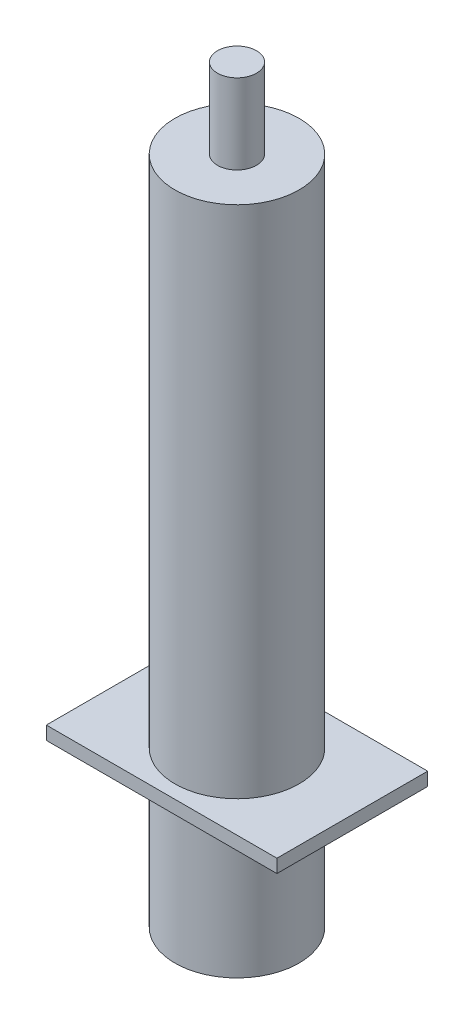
ISO-10303-21;
HEADER;
FILE_DESCRIPTION(('STEP AP214'),'2;1');
FILE_NAME('part.step','',(''),(''),'','','');
FILE_SCHEMA(('AUTOMOTIVE_DESIGN { 1 0 10303 214 1 1 1 1 }'));
ENDSEC;
DATA;
#1=APPLICATION_CONTEXT('core data for automotive mechanical design processes');
#2=APPLICATION_PROTOCOL_DEFINITION('international standard','automotive_design',2000,#1);
#3=PRODUCT_CONTEXT('',#1,'mechanical');
#4=PRODUCT('Part','Part','',(#3));
#5=PRODUCT_RELATED_PRODUCT_CATEGORY('part','',(#4));
#6=PRODUCT_DEFINITION_FORMATION('','',#4);
#7=PRODUCT_DEFINITION_CONTEXT('part definition',#1,'design');
#8=PRODUCT_DEFINITION('design','',#6,#7);
#9=PRODUCT_DEFINITION_SHAPE('','',#8);
#10=(LENGTH_UNIT() NAMED_UNIT(*) SI_UNIT(.MILLI.,.METRE.));
#11=(NAMED_UNIT(*) PLANE_ANGLE_UNIT() SI_UNIT($,.RADIAN.));
#12=(NAMED_UNIT(*) SI_UNIT($,.STERADIAN.) SOLID_ANGLE_UNIT());
#13=UNCERTAINTY_MEASURE_WITH_UNIT(LENGTH_MEASURE(1.E-05),#10,'distance_accuracy_value','');
#14=(GEOMETRIC_REPRESENTATION_CONTEXT(3) GLOBAL_UNCERTAINTY_ASSIGNED_CONTEXT((#13)) GLOBAL_UNIT_ASSIGNED_CONTEXT((#10,
#11,#12)) REPRESENTATION_CONTEXT('',''));
#15=CARTESIAN_POINT('',(0.,0.,0.));
#16=DIRECTION('',(0.,0.,1.));
#17=DIRECTION('',(1.,0.,0.));
#18=AXIS2_PLACEMENT_3D('',#15,#16,#17);
#19=CARTESIAN_POINT('',(0.,58.,0.));
#20=DIRECTION('',(0.,-1.,0.));
#21=DIRECTION('',(0.,0.,-1.));
#22=AXIS2_PLACEMENT_3D('',#19,#20,#21);
#23=CYLINDRICAL_SURFACE('',#22,7.);
#24=CARTESIAN_POINT('',(0.,58.,0.));
#25=DIRECTION('',(0.,1.,0.));
#26=DIRECTION('',(0.,0.,1.));
#27=AXIS2_PLACEMENT_3D('',#24,#25,#26);
#28=CIRCLE('',#27,7.);
#29=CARTESIAN_POINT('',(0.,58.,-7.));
#30=VERTEX_POINT('',#29);
#31=EDGE_CURVE('E125',#30,#30,#28,.T.);
#32=CARTESIAN_POINT('',(0.,0.,0.));
#33=DIRECTION('',(0.,1.,0.));
#34=DIRECTION('',(0.,0.,1.));
#35=AXIS2_PLACEMENT_3D('',#32,#33,#34);
#36=CIRCLE('',#35,7.);
#37=CARTESIAN_POINT('',(0.,0.,-7.));
#38=VERTEX_POINT('',#37);
#39=EDGE_CURVE('E44',#38,#38,#36,.T.);
#40=CARTESIAN_POINT('',(0.,58.,-7.));
#41=CARTESIAN_POINT('',(0.,57.3958333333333,-7.));
#42=CARTESIAN_POINT('',(0.,56.7916666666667,-7.));
#43=CARTESIAN_POINT('',(0.,55.5833333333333,-7.));
#44=CARTESIAN_POINT('',(0.,54.9791666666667,-7.));
#45=CARTESIAN_POINT('',(0.,53.7708333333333,-7.));
#46=CARTESIAN_POINT('',(0.,53.1666666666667,-7.));
#47=CARTESIAN_POINT('',(0.,51.9583333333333,-7.));
#48=CARTESIAN_POINT('',(0.,51.3541666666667,-7.));
#49=CARTESIAN_POINT('',(0.,50.1458333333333,-7.));
#50=CARTESIAN_POINT('',(0.,49.5416666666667,-7.));
#51=CARTESIAN_POINT('',(0.,48.3333333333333,-7.));
#52=CARTESIAN_POINT('',(0.,47.7291666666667,-7.));
#53=CARTESIAN_POINT('',(0.,46.5208333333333,-7.));
#54=CARTESIAN_POINT('',(0.,45.9166666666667,-7.));
#55=CARTESIAN_POINT('',(0.,44.7083333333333,-7.));
#56=CARTESIAN_POINT('',(0.,44.1041666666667,-7.));
#57=CARTESIAN_POINT('',(0.,42.8958333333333,-7.));
#58=CARTESIAN_POINT('',(0.,42.2916666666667,-7.));
#59=CARTESIAN_POINT('',(0.,41.0833333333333,-7.));
#60=CARTESIAN_POINT('',(0.,40.4791666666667,-7.));
#61=CARTESIAN_POINT('',(0.,39.2708333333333,-7.));
#62=CARTESIAN_POINT('',(0.,38.6666666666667,-7.));
#63=CARTESIAN_POINT('',(0.,37.4583333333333,-7.));
#64=CARTESIAN_POINT('',(0.,36.8541666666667,-7.));
#65=CARTESIAN_POINT('',(0.,35.6458333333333,-7.));
#66=CARTESIAN_POINT('',(0.,35.0416666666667,-7.));
#67=CARTESIAN_POINT('',(0.,33.8333333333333,-7.));
#68=CARTESIAN_POINT('',(0.,33.2291666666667,-7.));
#69=CARTESIAN_POINT('',(0.,32.0208333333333,-7.));
#70=CARTESIAN_POINT('',(0.,31.4166666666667,-7.));
#71=CARTESIAN_POINT('',(0.,30.2083333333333,-7.));
#72=CARTESIAN_POINT('',(0.,29.6041666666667,-7.));
#73=CARTESIAN_POINT('',(0.,28.3958333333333,-7.));
#74=CARTESIAN_POINT('',(0.,27.7916666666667,-7.));
#75=CARTESIAN_POINT('',(0.,26.5833333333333,-7.));
#76=CARTESIAN_POINT('',(0.,25.9791666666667,-7.));
#77=CARTESIAN_POINT('',(0.,24.7708333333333,-7.));
#78=CARTESIAN_POINT('',(0.,24.1666666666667,-7.));
#79=CARTESIAN_POINT('',(0.,22.9583333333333,-7.));
#80=CARTESIAN_POINT('',(0.,22.3541666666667,-7.));
#81=CARTESIAN_POINT('',(0.,21.1458333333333,-7.));
#82=CARTESIAN_POINT('',(0.,20.5416666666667,-7.));
#83=CARTESIAN_POINT('',(0.,19.3333333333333,-7.));
#84=CARTESIAN_POINT('',(0.,18.7291666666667,-7.));
#85=CARTESIAN_POINT('',(0.,17.5208333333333,-7.));
#86=CARTESIAN_POINT('',(0.,16.9166666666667,-7.));
#87=CARTESIAN_POINT('',(0.,15.7083333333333,-7.));
#88=CARTESIAN_POINT('',(0.,15.1041666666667,-7.));
#89=CARTESIAN_POINT('',(0.,13.8958333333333,-7.));
#90=CARTESIAN_POINT('',(0.,13.2916666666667,-7.));
#91=CARTESIAN_POINT('',(0.,12.0833333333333,-7.));
#92=CARTESIAN_POINT('',(0.,11.4791666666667,-7.));
#93=CARTESIAN_POINT('',(0.,10.2708333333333,-7.));
#94=CARTESIAN_POINT('',(0.,9.66666666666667,-7.));
#95=CARTESIAN_POINT('',(0.,8.45833333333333,-7.));
#96=CARTESIAN_POINT('',(0.,7.85416666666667,-7.));
#97=CARTESIAN_POINT('',(0.,6.64583333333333,-7.));
#98=CARTESIAN_POINT('',(0.,6.04166666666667,-7.));
#99=CARTESIAN_POINT('',(0.,4.83333333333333,-7.));
#100=CARTESIAN_POINT('',(0.,4.22916666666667,-7.));
#101=CARTESIAN_POINT('',(0.,3.02083333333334,-7.));
#102=CARTESIAN_POINT('',(0.,2.41666666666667,-7.));
#103=CARTESIAN_POINT('',(0.,1.20833333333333,-7.));
#104=CARTESIAN_POINT('',(0.,0.604166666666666,-7.));
#105=CARTESIAN_POINT('',(0.,0.,-7.));
#106=B_SPLINE_CURVE_WITH_KNOTS('',3,(#40,#41,#42,#43,#44,#45,#46,#47,#48,#49,#50,#51,#52,#53,
#54,#55,#56,#57,#58,#59,#60,#61,#62,#63,#64,#65,#66,#67,#68,#69,#70,#71,#72,#73,#74,#75,#76,#77,
#78,#79,#80,#81,#82,#83,#84,#85,#86,#87,#88,#89,#90,#91,#92,#93,#94,#95,#96,#97,#98,#99,#100,
#101,#102,#103,#104,#105),.UNSPECIFIED.,.F.,.F.,(4,2,2,2,2,2,2,2,2,2,2,2,2,2,2,2,2,2,2,2,2,2,2,
2,2,2,2,2,2,2,2,2,4),(0.,1.8125,3.625,5.4375,7.25000000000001,9.0625,10.875,12.6875,14.5,
16.3125,18.125,19.9375,21.75,23.5625,25.375,27.1875,29.,30.8125,32.625,34.4375,36.25,38.0625,
39.875,41.6875,43.5,45.3125,47.125,48.9375,50.75,52.5625,54.375,56.1875,58.),.UNSPECIFIED.);
#107=EDGE_CURVE('BSEAM41',#30,#38,#106,.T.);
#108=ORIENTED_EDGE('',*,*,#31,.F.);
#109=ORIENTED_EDGE('',*,*,#39,.T.);
#110=ORIENTED_EDGE('',*,*,#107,.T.);
#111=ORIENTED_EDGE('',*,*,#107,.F.);
#112=EDGE_LOOP('',(#108,#110,#109,#111));
#113=FACE_BOUND('',#112,.T.);
#114=ADVANCED_FACE('F41',(#113),#23,.T.);
#115=CARTESIAN_POINT('',(0.,58.,0.));
#116=DIRECTION('',(0.,1.,0.));
#117=DIRECTION('',(0.,0.,1.));
#118=AXIS2_PLACEMENT_3D('',#115,#116,#117);
#119=PLANE('',#118);
#120=CARTESIAN_POINT('',(0.,58.,0.));
#121=DIRECTION('',(0.,1.,0.));
#122=DIRECTION('',(0.,0.,1.));
#123=AXIS2_PLACEMENT_3D('',#120,#121,#122);
#124=CIRCLE('',#123,2.2);
#125=CARTESIAN_POINT('',(0.,58.,2.2));
#126=VERTEX_POINT('',#125);
#127=EDGE_CURVE('E50',#126,#126,#124,.T.);
#128=ORIENTED_EDGE('',*,*,#127,.F.);
#129=EDGE_LOOP('',(#128));
#130=FACE_BOUND('',#129,.T.);
#131=ORIENTED_EDGE('',*,*,#31,.T.);
#132=EDGE_LOOP('',(#131));
#133=FACE_BOUND('',#132,.T.);
#134=ADVANCED_FACE('F130',(#130,#133),#119,.T.);
#135=CARTESIAN_POINT('',(0.,67.,0.));
#136=DIRECTION('',(0.,-1.,0.));
#137=DIRECTION('',(0.,0.,-1.));
#138=AXIS2_PLACEMENT_3D('',#135,#136,#137);
#139=CYLINDRICAL_SURFACE('',#138,2.2);
#140=CARTESIAN_POINT('',(0.,67.,0.));
#141=DIRECTION('',(0.,1.,0.));
#142=DIRECTION('',(0.,0.,1.));
#143=AXIS2_PLACEMENT_3D('',#140,#141,#142);
#144=CIRCLE('',#143,2.2);
#145=CARTESIAN_POINT('',(0.,67.,2.2));
#146=VERTEX_POINT('',#145);
#147=EDGE_CURVE('E122',#146,#146,#144,.T.);
#148=ORIENTED_EDGE('',*,*,#147,.F.);
#149=EDGE_LOOP('',(#148));
#150=FACE_BOUND('',#149,.T.);
#151=ORIENTED_EDGE('',*,*,#127,.T.);
#152=EDGE_LOOP('',(#151));
#153=FACE_BOUND('',#152,.T.);
#154=ADVANCED_FACE('F159',(#150,#153),#139,.T.);
#155=CARTESIAN_POINT('',(0.,67.,0.));
#156=DIRECTION('',(0.,1.,0.));
#157=DIRECTION('',(0.,0.,1.));
#158=AXIS2_PLACEMENT_3D('',#155,#156,#157);
#159=PLANE('',#158);
#160=ORIENTED_EDGE('',*,*,#147,.T.);
#161=EDGE_LOOP('',(#160));
#162=FACE_BOUND('',#161,.T.);
#163=ADVANCED_FACE('F151',(#162),#159,.T.);
#164=CARTESIAN_POINT('',(-13.,-1.5,8.5));
#165=DIRECTION('',(0.,0.,1.));
#166=DIRECTION('',(1.,0.,0.));
#167=AXIS2_PLACEMENT_3D('',#164,#165,#166);
#168=PLANE('',#167);
#169=DIRECTION('',(1.,0.,0.));
#170=VECTOR('',#169,1.);
#171=CARTESIAN_POINT('',(-13.,0.,8.5));
#172=LINE('',#171,#170);
#173=CARTESIAN_POINT('',(-13.,0.,8.5));
#174=VERTEX_POINT('',#173);
#175=CARTESIAN_POINT('',(13.,0.,8.5));
#176=VERTEX_POINT('',#175);
#177=EDGE_CURVE('E110',#174,#176,#172,.T.);
#178=ORIENTED_EDGE('',*,*,#177,.F.);
#179=DIRECTION('',(0.,1.,0.));
#180=VECTOR('',#179,1.);
#181=CARTESIAN_POINT('',(-13.,-1.5,8.5));
#182=LINE('',#181,#180);
#183=CARTESIAN_POINT('',(-13.,-1.5,8.5));
#184=VERTEX_POINT('',#183);
#185=EDGE_CURVE('E59',#184,#174,#182,.T.);
#186=ORIENTED_EDGE('',*,*,#185,.F.);
#187=DIRECTION('',(1.,0.,0.));
#188=VECTOR('',#187,1.);
#189=CARTESIAN_POINT('',(-13.,-1.5,8.5));
#190=LINE('',#189,#188);
#191=CARTESIAN_POINT('',(13.,-1.5,8.5));
#192=VERTEX_POINT('',#191);
#193=EDGE_CURVE('E104',#184,#192,#190,.T.);
#194=ORIENTED_EDGE('',*,*,#193,.T.);
#195=DIRECTION('',(0.,1.,0.));
#196=VECTOR('',#195,1.);
#197=CARTESIAN_POINT('',(13.,-1.5,8.5));
#198=LINE('',#197,#196);
#199=EDGE_CURVE('E101',#192,#176,#198,.T.);
#200=ORIENTED_EDGE('',*,*,#199,.T.);
#201=EDGE_LOOP('',(#178,#186,#194,#200));
#202=FACE_BOUND('',#201,.T.);
#203=ADVANCED_FACE('F142',(#202),#168,.T.);
#204=CARTESIAN_POINT('',(-13.,-1.5,-8.5));
#205=DIRECTION('',(-1.,0.,0.));
#206=DIRECTION('',(0.,0.,1.));
#207=AXIS2_PLACEMENT_3D('',#204,#205,#206);
#208=PLANE('',#207);
#209=DIRECTION('',(0.,0.,1.));
#210=VECTOR('',#209,1.);
#211=CARTESIAN_POINT('',(-13.,0.,-8.5));
#212=LINE('',#211,#210);
#213=CARTESIAN_POINT('',(-13.,0.,-8.5));
#214=VERTEX_POINT('',#213);
#215=EDGE_CURVE('E106',#214,#174,#212,.T.);
#216=ORIENTED_EDGE('',*,*,#215,.F.);
#217=DIRECTION('',(0.,1.,0.));
#218=VECTOR('',#217,1.);
#219=CARTESIAN_POINT('',(-13.,-1.5,-8.5));
#220=LINE('',#219,#218);
#221=CARTESIAN_POINT('',(-13.,-1.5,-8.5));
#222=VERTEX_POINT('',#221);
#223=EDGE_CURVE('E75',#222,#214,#220,.T.);
#224=ORIENTED_EDGE('',*,*,#223,.F.);
#225=DIRECTION('',(0.,0.,1.));
#226=VECTOR('',#225,1.);
#227=CARTESIAN_POINT('',(-13.,-1.5,-8.5));
#228=LINE('',#227,#226);
#229=EDGE_CURVE('E92',#222,#184,#228,.T.);
#230=ORIENTED_EDGE('',*,*,#229,.T.);
#231=ORIENTED_EDGE('',*,*,#185,.T.);
#232=EDGE_LOOP('',(#216,#224,#230,#231));
#233=FACE_BOUND('',#232,.T.);
#234=ADVANCED_FACE('F143',(#233),#208,.T.);
#235=CARTESIAN_POINT('',(-13.,-1.5,-8.5));
#236=DIRECTION('',(0.,0.,1.));
#237=DIRECTION('',(1.,0.,0.));
#238=AXIS2_PLACEMENT_3D('',#235,#236,#237);
#239=PLANE('',#238);
#240=DIRECTION('',(1.,0.,0.));
#241=VECTOR('',#240,1.);
#242=CARTESIAN_POINT('',(-13.,0.,-8.5));
#243=LINE('',#242,#241);
#244=CARTESIAN_POINT('',(13.,0.,-8.5));
#245=VERTEX_POINT('',#244);
#246=EDGE_CURVE('E97',#214,#245,#243,.T.);
#247=ORIENTED_EDGE('',*,*,#246,.T.);
#248=DIRECTION('',(0.,1.,0.));
#249=VECTOR('',#248,1.);
#250=CARTESIAN_POINT('',(13.,-1.5,-8.5));
#251=LINE('',#250,#249);
#252=CARTESIAN_POINT('',(13.,-1.5,-8.5));
#253=VERTEX_POINT('',#252);
#254=EDGE_CURVE('E95',#253,#245,#251,.T.);
#255=ORIENTED_EDGE('',*,*,#254,.F.);
#256=DIRECTION('',(1.,0.,0.));
#257=VECTOR('',#256,1.);
#258=CARTESIAN_POINT('',(-13.,-1.5,-8.5));
#259=LINE('',#258,#257);
#260=EDGE_CURVE('E89',#222,#253,#259,.T.);
#261=ORIENTED_EDGE('',*,*,#260,.F.);
#262=ORIENTED_EDGE('',*,*,#223,.T.);
#263=EDGE_LOOP('',(#247,#255,#261,#262));
#264=FACE_BOUND('',#263,.T.);
#265=ADVANCED_FACE('F96',(#264),#239,.F.);
#266=CARTESIAN_POINT('',(13.,-1.5,-8.5));
#267=DIRECTION('',(-1.,0.,0.));
#268=DIRECTION('',(0.,0.,1.));
#269=AXIS2_PLACEMENT_3D('',#266,#267,#268);
#270=PLANE('',#269);
#271=DIRECTION('',(0.,0.,1.));
#272=VECTOR('',#271,1.);
#273=CARTESIAN_POINT('',(13.,0.,-8.5));
#274=LINE('',#273,#272);
#275=EDGE_CURVE('E113',#245,#176,#274,.T.);
#276=ORIENTED_EDGE('',*,*,#275,.T.);
#277=ORIENTED_EDGE('',*,*,#199,.F.);
#278=DIRECTION('',(0.,0.,1.));
#279=VECTOR('',#278,1.);
#280=CARTESIAN_POINT('',(13.,-1.5,-8.5));
#281=LINE('',#280,#279);
#282=EDGE_CURVE('E86',#253,#192,#281,.T.);
#283=ORIENTED_EDGE('',*,*,#282,.F.);
#284=ORIENTED_EDGE('',*,*,#254,.T.);
#285=EDGE_LOOP('',(#276,#277,#283,#284));
#286=FACE_BOUND('',#285,.T.);
#287=ADVANCED_FACE('F103',(#286),#270,.F.);
#288=CARTESIAN_POINT('',(0.,-1.5,0.));
#289=DIRECTION('',(0.,-1.,0.));
#290=DIRECTION('',(0.,0.,-1.));
#291=AXIS2_PLACEMENT_3D('',#288,#289,#290);
#292=PLANE('',#291);
#293=CARTESIAN_POINT('',(0.,-1.5,0.));
#294=DIRECTION('',(0.,-1.,0.));
#295=DIRECTION('',(0.,0.,-1.));
#296=AXIS2_PLACEMENT_3D('',#293,#294,#295);
#297=CIRCLE('',#296,7.);
#298=CARTESIAN_POINT('',(0.,-1.5,-7.));
#299=VERTEX_POINT('',#298);
#300=EDGE_CURVE('E11',#299,#299,#297,.T.);
#301=ORIENTED_EDGE('',*,*,#300,.F.);
#302=EDGE_LOOP('',(#301));
#303=FACE_BOUND('',#302,.T.);
#304=ORIENTED_EDGE('',*,*,#193,.F.);
#305=ORIENTED_EDGE('',*,*,#229,.F.);
#306=ORIENTED_EDGE('',*,*,#260,.T.);
#307=ORIENTED_EDGE('',*,*,#282,.T.);
#308=EDGE_LOOP('',(#304,#305,#306,#307));
#309=FACE_BOUND('',#308,.T.);
#310=ADVANCED_FACE('F91',(#303,#309),#292,.T.);
#311=CARTESIAN_POINT('',(0.,0.,0.));
#312=DIRECTION('',(0.,-1.,0.));
#313=DIRECTION('',(0.,0.,-1.));
#314=AXIS2_PLACEMENT_3D('',#311,#312,#313);
#315=PLANE('',#314);
#316=ORIENTED_EDGE('',*,*,#39,.F.);
#317=EDGE_LOOP('',(#316));
#318=FACE_BOUND('',#317,.T.);
#319=ORIENTED_EDGE('',*,*,#177,.T.);
#320=ORIENTED_EDGE('',*,*,#275,.F.);
#321=ORIENTED_EDGE('',*,*,#246,.F.);
#322=ORIENTED_EDGE('',*,*,#215,.T.);
#323=EDGE_LOOP('',(#319,#320,#321,#322));
#324=FACE_BOUND('',#323,.T.);
#325=ADVANCED_FACE('F137',(#318,#324),#315,.F.);
#326=CARTESIAN_POINT('',(0.,-17.5,0.));
#327=DIRECTION('',(0.,1.,0.));
#328=DIRECTION('',(0.,0.,1.));
#329=AXIS2_PLACEMENT_3D('',#326,#327,#328);
#330=CYLINDRICAL_SURFACE('',#329,7.);
#331=CARTESIAN_POINT('',(0.,-17.5,0.));
#332=DIRECTION('',(0.,-1.,0.));
#333=DIRECTION('',(0.,0.,-1.));
#334=AXIS2_PLACEMENT_3D('',#331,#332,#333);
#335=CIRCLE('',#334,7.);
#336=CARTESIAN_POINT('',(0.,-17.5,-7.));
#337=VERTEX_POINT('',#336);
#338=EDGE_CURVE('E114',#337,#337,#335,.T.);
#339=ORIENTED_EDGE('',*,*,#338,.F.);
#340=EDGE_LOOP('',(#339));
#341=FACE_BOUND('',#340,.T.);
#342=ORIENTED_EDGE('',*,*,#300,.T.);
#343=EDGE_LOOP('',(#342));
#344=FACE_BOUND('',#343,.T.);
#345=ADVANCED_FACE('F140',(#341,#344),#330,.T.);
#346=CARTESIAN_POINT('',(0.,-17.5,0.));
#347=DIRECTION('',(0.,-1.,0.));
#348=DIRECTION('',(0.,0.,-1.));
#349=AXIS2_PLACEMENT_3D('',#346,#347,#348);
#350=PLANE('',#349);
#351=ORIENTED_EDGE('',*,*,#338,.T.);
#352=EDGE_LOOP('',(#351));
#353=FACE_BOUND('',#352,.T.);
#354=ADVANCED_FACE('F226',(#353),#350,.T.);
#355=CLOSED_SHELL('',(#114,#134,#154,#163,#203,#234,#265,#287,#310,#325,#345,#354));
#356=MANIFOLD_SOLID_BREP('B2',#355);
#357=ADVANCED_BREP_SHAPE_REPRESENTATION('',(#18,#356),#14);
#358=SHAPE_DEFINITION_REPRESENTATION(#9,#357);
ENDSEC;
END-ISO-10303-21;
